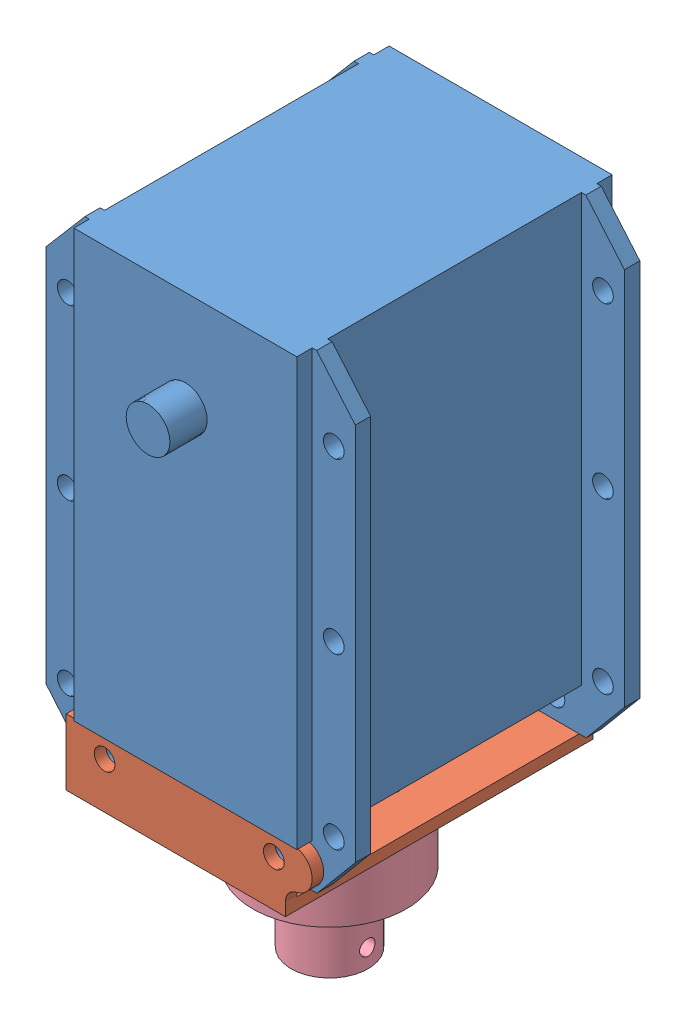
SolidWorks assembly X1.SLDASM, configuration Default (file format 16000). Lengths in mm.
Overall size (40.2 84.8 47.35).
4 component instances, 4 part files, 9 mates.
Components (placement in the parent):
- Actuator2-2: Actuator2.SLDPRT [Default] at (-36.4926 -24.0344 39.3301) size (40.2 61.1 47.35)
- Frame1-1: Frame1.SLDPRT [Default] at (-36.4926 -60.5844 59.3301) x (0 1 0) z (-1 0 0) size (8.6 40 32)
- Disk_driver1-1: Disk_driver1.SLDPRT [Default] at (-38.2354 -61.5844 39.3301) x (0 -1 0) z (0 0 1) size (5 22 22)
- motor_rod-1: motor_rod.SLDPRT [Default] at (-38.2354 -71.9094 39.3301) x (-1 0 0) z (0 0 -1) size (20 23.55 20)
Mates (geometry in assembly coordinates):
- Concentric1: concentric: cylinder of Actuator2-2 through (-25.4926 -54.5844 55.8301) axis (0 0 1) radius 1.35; cylinder of Frame1-1 through (-25.4926 -54.5844 59.3301) axis (0 0 -1) radius 1.35
- Concentric2: concentric: cylinder of Actuator2-2 through (-47.4926 -54.5844 55.8301) axis (0 0 1) radius 1.35; cylinder of Frame1-1 through (-47.4926 -54.5844 59.3301) axis (0 0 -1) radius 1.35
- Coincident1: coincident: plane of Actuator2-2 through (-36.4926 -24.0344 57.8301) normal (0 0 1); plane of Frame1-1 through (-52.4926 -59.0844 57.8301) normal (0 0 -1)
- Concentric3: concentric: cylinder of Frame1-1 through (-38.2354 -51.9844 39.3301) axis (0 -1 0) radius 3.8; cylinder of Disk_driver1-1 through (-38.2354 -61.5844 39.3301) axis (0 1 0) radius 3.75
- Concentric4: concentric: cylinder of Frame1-1 through (-46.2354 -60.5844 39.3301) axis (0 1 0) radius 1; cylinder of Disk_driver1-1 through (-46.2354 -62.5844 39.3301) axis (0 1 0) radius 1
- Coincident2: coincident: plane of Frame1-1 through (-52.4926 -60.5844 59.3301) normal (0 -1 0); plane of Disk_driver1-1 through (-27.2354 -60.5844 39.3301) normal (0 1 0)
- Concentric5: concentric: cylinder of Disk_driver1-1 through (-38.2354 -61.5844 39.3301) axis (0 1 0) radius 3; cylinder of motor_rod-1 through (-38.2354 -76.2344 39.3301) axis (0 -1 0) radius 3
- Concentric6: concentric: cylinder of Disk_driver1-1 through (-30.2354 -62.5844 39.3301) axis (0 1 0) radius 1; cylinder of motor_rod-1 through (-30.2354 -59.0844 39.3301) axis (0 -1 0) radius 1
- Coincident3: coincident: plane of Disk_driver1-1 through (-35.2354 -62.5844 39.3301) normal (0 -1 0); plane of motor_rod-1 through (-48.2354 -62.5844 39.3301) normal (0 1 0)
